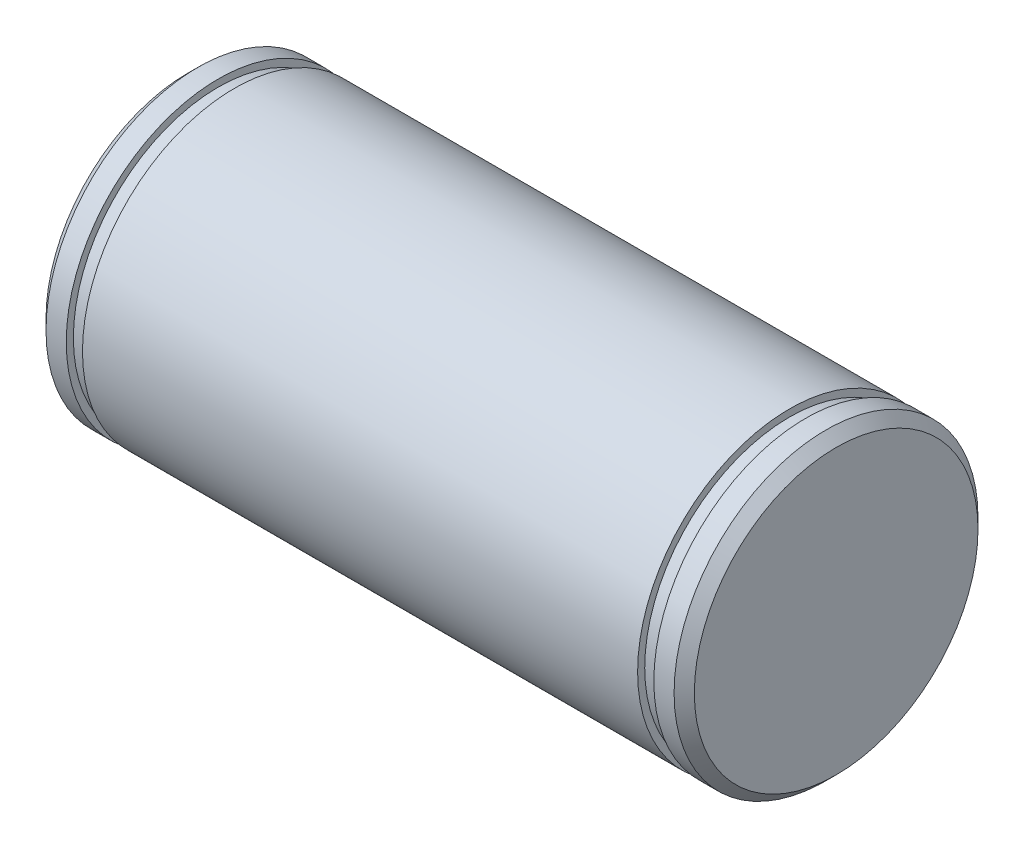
from build123d import *


with BuildPart() as part:
    # Esquisse1 → R_volution1 (revolve)
    with BuildSketch(Plane.XY, mode=Mode.PRIVATE) as r_volution1_sk:
        Polygon((-16.94707828, 23.315937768), (-15.94707828, 24.315937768), (-13.94707828, 24.315937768), (-13.94707828, 23.615937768), (-12.34707828, 23.615937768), (-12.34707828, 24.315937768), (42.45292172, 24.315937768), (42.45292172, 23.615937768), (44.05292172, 23.615937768), (44.05292172, 24.315937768), (46.05292172, 24.315937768), (47.05292172, 23.315937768), (47.05292172, 9.315937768), (-16.94707828, 9.315937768), align=None)
    revolve(r_volution1_sk.sketch.rotate(Axis((-28.245130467, 9.315937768, 0), (1, 0, 0)), 90), axis=Axis((-28.245130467, 9.315937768, 0), (1, 0, 0)))


solid = part.part
